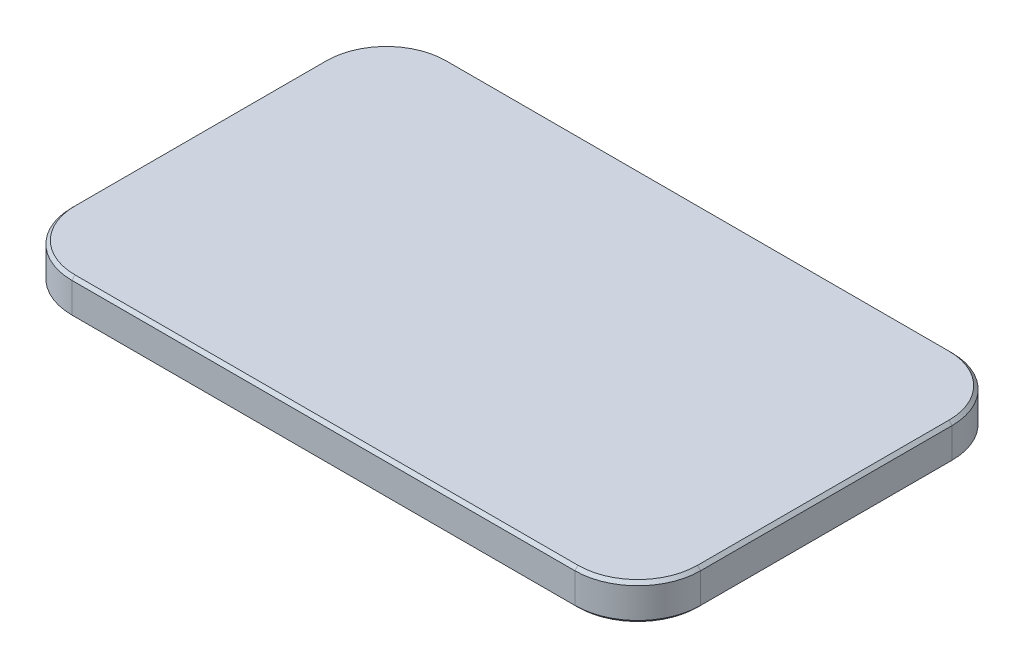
ISO-10303-21;
HEADER;
FILE_DESCRIPTION(('STEP AP214'),'2;1');
FILE_NAME('part.step','',(''),(''),'','','');
FILE_SCHEMA(('AUTOMOTIVE_DESIGN { 1 0 10303 214 1 1 1 1 }'));
ENDSEC;
DATA;
#1=APPLICATION_CONTEXT('core data for automotive mechanical design processes');
#2=APPLICATION_PROTOCOL_DEFINITION('international standard','automotive_design',2000,#1);
#3=PRODUCT_CONTEXT('',#1,'mechanical');
#4=PRODUCT('Part','Part','',(#3));
#5=PRODUCT_RELATED_PRODUCT_CATEGORY('part','',(#4));
#6=PRODUCT_DEFINITION_FORMATION('','',#4);
#7=PRODUCT_DEFINITION_CONTEXT('part definition',#1,'design');
#8=PRODUCT_DEFINITION('design','',#6,#7);
#9=PRODUCT_DEFINITION_SHAPE('','',#8);
#10=(LENGTH_UNIT() NAMED_UNIT(*) SI_UNIT(.MILLI.,.METRE.));
#11=(NAMED_UNIT(*) PLANE_ANGLE_UNIT() SI_UNIT($,.RADIAN.));
#12=(NAMED_UNIT(*) SI_UNIT($,.STERADIAN.) SOLID_ANGLE_UNIT());
#13=UNCERTAINTY_MEASURE_WITH_UNIT(LENGTH_MEASURE(1.E-05),#10,'distance_accuracy_value','');
#14=(GEOMETRIC_REPRESENTATION_CONTEXT(3) GLOBAL_UNCERTAINTY_ASSIGNED_CONTEXT((#13)) GLOBAL_UNIT_ASSIGNED_CONTEXT((#10,
#11,#12)) REPRESENTATION_CONTEXT('',''));
#15=CARTESIAN_POINT('',(0.,0.,0.));
#16=DIRECTION('',(0.,0.,1.));
#17=DIRECTION('',(1.,0.,0.));
#18=AXIS2_PLACEMENT_3D('',#15,#16,#17);
#19=CARTESIAN_POINT('',(-63.5,7.34272236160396,-38.1));
#20=DIRECTION('',(1.,0.,0.));
#21=DIRECTION('',(0.,0.,-1.));
#22=AXIS2_PLACEMENT_3D('',#19,#20,#21);
#23=PLANE('',#22);
#24=DIRECTION('',(0.,-1.,0.));
#25=VECTOR('',#24,1.);
#26=CARTESIAN_POINT('',(-63.5,7.34272236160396,-25.4));
#27=LINE('',#26,#25);
#28=CARTESIAN_POINT('',(-63.5,6.70772236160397,-25.4));
#29=VERTEX_POINT('',#28);
#30=CARTESIAN_POINT('',(-63.5,0.634999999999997,-25.4));
#31=VERTEX_POINT('',#30);
#32=EDGE_CURVE('E277',#29,#31,#27,.T.);
#33=ORIENTED_EDGE('',*,*,#32,.T.);
#34=DIRECTION('',(0.,0.,1.));
#35=VECTOR('',#34,1.);
#36=CARTESIAN_POINT('',(-63.5,0.634999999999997,-38.1));
#37=LINE('',#36,#35);
#38=CARTESIAN_POINT('',(-63.5,0.634999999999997,25.4));
#39=VERTEX_POINT('',#38);
#40=EDGE_CURVE('E205',#31,#39,#37,.T.);
#41=ORIENTED_EDGE('',*,*,#40,.T.);
#42=DIRECTION('',(0.,-1.,0.));
#43=VECTOR('',#42,1.);
#44=CARTESIAN_POINT('',(-63.5,7.34272236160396,25.4));
#45=LINE('',#44,#43);
#46=CARTESIAN_POINT('',(-63.5,6.70772236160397,25.4));
#47=VERTEX_POINT('',#46);
#48=EDGE_CURVE('E236',#39,#47,#45,.F.);
#49=ORIENTED_EDGE('',*,*,#48,.T.);
#50=DIRECTION('',(0.,0.,-1.));
#51=VECTOR('',#50,1.);
#52=CARTESIAN_POINT('',(-63.5,6.70772236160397,-25.4));
#53=LINE('',#52,#51);
#54=EDGE_CURVE('E203',#47,#29,#53,.T.);
#55=ORIENTED_EDGE('',*,*,#54,.T.);
#56=EDGE_LOOP('',(#33,#41,#49,#55));
#57=FACE_BOUND('',#56,.T.);
#58=ADVANCED_FACE('F31',(#57),#23,.F.);
#59=CARTESIAN_POINT('',(-63.5,7.34272236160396,38.1));
#60=DIRECTION('',(0.,0.,-1.));
#61=DIRECTION('',(-1.,0.,0.));
#62=AXIS2_PLACEMENT_3D('',#59,#60,#61);
#63=PLANE('',#62);
#64=DIRECTION('',(0.,-1.,0.));
#65=VECTOR('',#64,1.);
#66=CARTESIAN_POINT('',(-50.8,7.34272236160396,38.1));
#67=LINE('',#66,#65);
#68=CARTESIAN_POINT('',(-50.8,6.70772236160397,38.1));
#69=VERTEX_POINT('',#68);
#70=CARTESIAN_POINT('',(-50.8,0.634999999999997,38.1));
#71=VERTEX_POINT('',#70);
#72=EDGE_CURVE('E164',#69,#71,#67,.T.);
#73=ORIENTED_EDGE('',*,*,#72,.T.);
#74=DIRECTION('',(1.,0.,0.));
#75=VECTOR('',#74,1.);
#76=CARTESIAN_POINT('',(-63.5,0.634999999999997,38.1));
#77=LINE('',#76,#75);
#78=CARTESIAN_POINT('',(50.8,0.634999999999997,38.1));
#79=VERTEX_POINT('',#78);
#80=EDGE_CURVE('E180',#71,#79,#77,.T.);
#81=ORIENTED_EDGE('',*,*,#80,.T.);
#82=DIRECTION('',(0.,-1.,0.));
#83=VECTOR('',#82,1.);
#84=CARTESIAN_POINT('',(50.8,7.34272236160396,38.1));
#85=LINE('',#84,#83);
#86=CARTESIAN_POINT('',(50.8,6.70772236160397,38.1));
#87=VERTEX_POINT('',#86);
#88=EDGE_CURVE('E293',#79,#87,#85,.F.);
#89=ORIENTED_EDGE('',*,*,#88,.T.);
#90=DIRECTION('',(-1.,0.,0.));
#91=VECTOR('',#90,1.);
#92=CARTESIAN_POINT('',(-50.8,6.70772236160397,38.1));
#93=LINE('',#92,#91);
#94=EDGE_CURVE('E178',#87,#69,#93,.T.);
#95=ORIENTED_EDGE('',*,*,#94,.T.);
#96=EDGE_LOOP('',(#73,#81,#89,#95));
#97=FACE_BOUND('',#96,.T.);
#98=ADVANCED_FACE('F315',(#97),#63,.F.);
#99=CARTESIAN_POINT('',(63.5,7.34272236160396,-38.1));
#100=DIRECTION('',(-1.,0.,0.));
#101=DIRECTION('',(0.,0.,1.));
#102=AXIS2_PLACEMENT_3D('',#99,#100,#101);
#103=PLANE('',#102);
#104=DIRECTION('',(0.,-1.,0.));
#105=VECTOR('',#104,1.);
#106=CARTESIAN_POINT('',(63.5,7.34272236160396,25.4));
#107=LINE('',#106,#105);
#108=CARTESIAN_POINT('',(63.5,6.70772236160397,25.4));
#109=VERTEX_POINT('',#108);
#110=CARTESIAN_POINT('',(63.5,0.634999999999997,25.4));
#111=VERTEX_POINT('',#110);
#112=EDGE_CURVE('E287',#109,#111,#107,.T.);
#113=ORIENTED_EDGE('',*,*,#112,.T.);
#114=DIRECTION('',(0.,0.,-1.));
#115=VECTOR('',#114,1.);
#116=CARTESIAN_POINT('',(63.5,0.634999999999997,-38.1));
#117=LINE('',#116,#115);
#118=CARTESIAN_POINT('',(63.5,0.634999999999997,-25.4));
#119=VERTEX_POINT('',#118);
#120=EDGE_CURVE('E188',#111,#119,#117,.T.);
#121=ORIENTED_EDGE('',*,*,#120,.T.);
#122=DIRECTION('',(0.,-1.,0.));
#123=VECTOR('',#122,1.);
#124=CARTESIAN_POINT('',(63.5,7.34272236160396,-25.4));
#125=LINE('',#124,#123);
#126=CARTESIAN_POINT('',(63.5,6.70772236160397,-25.4));
#127=VERTEX_POINT('',#126);
#128=EDGE_CURVE('E290',#119,#127,#125,.F.);
#129=ORIENTED_EDGE('',*,*,#128,.T.);
#130=DIRECTION('',(0.,0.,1.));
#131=VECTOR('',#130,1.);
#132=CARTESIAN_POINT('',(63.5,6.70772236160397,25.4));
#133=LINE('',#132,#131);
#134=EDGE_CURVE('E186',#127,#109,#133,.T.);
#135=ORIENTED_EDGE('',*,*,#134,.T.);
#136=EDGE_LOOP('',(#113,#121,#129,#135));
#137=FACE_BOUND('',#136,.T.);
#138=ADVANCED_FACE('F359',(#137),#103,.F.);
#139=CARTESIAN_POINT('',(-63.5,7.34272236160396,-38.1));
#140=DIRECTION('',(0.,0.,1.));
#141=DIRECTION('',(1.,0.,0.));
#142=AXIS2_PLACEMENT_3D('',#139,#140,#141);
#143=PLANE('',#142);
#144=DIRECTION('',(0.,-1.,0.));
#145=VECTOR('',#144,1.);
#146=CARTESIAN_POINT('',(50.8,7.34272236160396,-38.1));
#147=LINE('',#146,#145);
#148=CARTESIAN_POINT('',(50.8,6.70772236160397,-38.1));
#149=VERTEX_POINT('',#148);
#150=CARTESIAN_POINT('',(50.8,0.634999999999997,-38.1));
#151=VERTEX_POINT('',#150);
#152=EDGE_CURVE('E279',#149,#151,#147,.T.);
#153=ORIENTED_EDGE('',*,*,#152,.T.);
#154=DIRECTION('',(-1.,0.,0.));
#155=VECTOR('',#154,1.);
#156=CARTESIAN_POINT('',(-63.5,0.634999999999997,-38.1));
#157=LINE('',#156,#155);
#158=CARTESIAN_POINT('',(-50.8,0.634999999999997,-38.1));
#159=VERTEX_POINT('',#158);
#160=EDGE_CURVE('E197',#151,#159,#157,.T.);
#161=ORIENTED_EDGE('',*,*,#160,.T.);
#162=DIRECTION('',(0.,-1.,0.));
#163=VECTOR('',#162,1.);
#164=CARTESIAN_POINT('',(-50.8,7.34272236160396,-38.1));
#165=LINE('',#164,#163);
#166=CARTESIAN_POINT('',(-50.8,6.70772236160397,-38.1));
#167=VERTEX_POINT('',#166);
#168=EDGE_CURVE('E284',#159,#167,#165,.F.);
#169=ORIENTED_EDGE('',*,*,#168,.T.);
#170=DIRECTION('',(1.,0.,0.));
#171=VECTOR('',#170,1.);
#172=CARTESIAN_POINT('',(50.8,6.70772236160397,-38.1));
#173=LINE('',#172,#171);
#174=EDGE_CURVE('E195',#167,#149,#173,.T.);
#175=ORIENTED_EDGE('',*,*,#174,.T.);
#176=EDGE_LOOP('',(#153,#161,#169,#175));
#177=FACE_BOUND('',#176,.T.);
#178=ADVANCED_FACE('F343',(#177),#143,.F.);
#179=CARTESIAN_POINT('',(-63.5,7.34272236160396,38.1));
#180=DIRECTION('',(0.,1.,0.));
#181=DIRECTION('',(0.,0.,1.));
#182=AXIS2_PLACEMENT_3D('',#179,#180,#181);
#183=PLANE('',#182);
#184=DIRECTION('',(0.,0.,-1.));
#185=VECTOR('',#184,1.);
#186=CARTESIAN_POINT('',(62.865,7.34272236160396,-25.4));
#187=LINE('',#186,#185);
#188=CARTESIAN_POINT('',(62.865,7.34272236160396,25.4));
#189=VERTEX_POINT('',#188);
#190=CARTESIAN_POINT('',(62.865,7.34272236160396,-25.4));
#191=VERTEX_POINT('',#190);
#192=EDGE_CURVE('E40',#189,#191,#187,.T.);
#193=ORIENTED_EDGE('',*,*,#192,.T.);
#194=CARTESIAN_POINT('',(50.8,7.34272236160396,-25.4));
#195=DIRECTION('',(0.,1.,0.));
#196=DIRECTION('',(0.,0.,1.));
#197=AXIS2_PLACEMENT_3D('',#194,#195,#196);
#198=CIRCLE('',#197,12.065);
#199=CARTESIAN_POINT('',(50.8,7.34272236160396,-37.465));
#200=VERTEX_POINT('',#199);
#201=EDGE_CURVE('E11',#191,#200,#198,.T.);
#202=ORIENTED_EDGE('',*,*,#201,.T.);
#203=DIRECTION('',(-1.,0.,0.));
#204=VECTOR('',#203,1.);
#205=CARTESIAN_POINT('',(-50.8,7.34272236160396,-37.465));
#206=LINE('',#205,#204);
#207=CARTESIAN_POINT('',(-50.8,7.34272236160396,-37.465));
#208=VERTEX_POINT('',#207);
#209=EDGE_CURVE('E207',#200,#208,#206,.T.);
#210=ORIENTED_EDGE('',*,*,#209,.T.);
#211=CARTESIAN_POINT('',(-50.8,7.34272236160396,-25.4));
#212=DIRECTION('',(0.,1.,0.));
#213=DIRECTION('',(0.,0.,1.));
#214=AXIS2_PLACEMENT_3D('',#211,#212,#213);
#215=CIRCLE('',#214,12.065);
#216=CARTESIAN_POINT('',(-62.865,7.34272236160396,-25.4));
#217=VERTEX_POINT('',#216);
#218=EDGE_CURVE('E209',#208,#217,#215,.T.);
#219=ORIENTED_EDGE('',*,*,#218,.T.);
#220=DIRECTION('',(0.,0.,1.));
#221=VECTOR('',#220,1.);
#222=CARTESIAN_POINT('',(-62.865,7.34272236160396,25.4));
#223=LINE('',#222,#221);
#224=CARTESIAN_POINT('',(-62.865,7.34272236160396,25.4));
#225=VERTEX_POINT('',#224);
#226=EDGE_CURVE('E211',#217,#225,#223,.T.);
#227=ORIENTED_EDGE('',*,*,#226,.T.);
#228=CARTESIAN_POINT('',(-50.8,7.34272236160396,25.4));
#229=DIRECTION('',(0.,1.,0.));
#230=DIRECTION('',(0.,0.,1.));
#231=AXIS2_PLACEMENT_3D('',#228,#229,#230);
#232=CIRCLE('',#231,12.065);
#233=CARTESIAN_POINT('',(-50.8,7.34272236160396,37.465));
#234=VERTEX_POINT('',#233);
#235=EDGE_CURVE('E213',#225,#234,#232,.T.);
#236=ORIENTED_EDGE('',*,*,#235,.T.);
#237=DIRECTION('',(1.,0.,0.));
#238=VECTOR('',#237,1.);
#239=CARTESIAN_POINT('',(50.8,7.34272236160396,37.465));
#240=LINE('',#239,#238);
#241=CARTESIAN_POINT('',(50.8,7.34272236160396,37.465));
#242=VERTEX_POINT('',#241);
#243=EDGE_CURVE('E215',#234,#242,#240,.T.);
#244=ORIENTED_EDGE('',*,*,#243,.T.);
#245=CARTESIAN_POINT('',(50.8,7.34272236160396,25.4));
#246=DIRECTION('',(0.,1.,0.));
#247=DIRECTION('',(0.,0.,1.));
#248=AXIS2_PLACEMENT_3D('',#245,#246,#247);
#249=CIRCLE('',#248,12.065);
#250=EDGE_CURVE('E51',#242,#189,#249,.T.);
#251=ORIENTED_EDGE('',*,*,#250,.T.);
#252=EDGE_LOOP('',(#193,#202,#210,#219,#227,#236,#244,#251));
#253=FACE_BOUND('',#252,.T.);
#254=ADVANCED_FACE('F331',(#253),#183,.T.);
#255=CARTESIAN_POINT('',(-63.5,0.,38.1));
#256=DIRECTION('',(0.,1.,0.));
#257=DIRECTION('',(0.,0.,1.));
#258=AXIS2_PLACEMENT_3D('',#255,#256,#257);
#259=PLANE('',#258);
#260=DIRECTION('',(-1.,0.,0.));
#261=VECTOR('',#260,1.);
#262=CARTESIAN_POINT('',(-63.5,0.,37.465));
#263=LINE('',#262,#261);
#264=CARTESIAN_POINT('',(50.8,0.,37.465));
#265=VERTEX_POINT('',#264);
#266=CARTESIAN_POINT('',(-50.8,0.,37.465));
#267=VERTEX_POINT('',#266);
#268=EDGE_CURVE('E168',#265,#267,#263,.T.);
#269=ORIENTED_EDGE('',*,*,#268,.T.);
#270=CARTESIAN_POINT('',(-50.8,0.,25.4));
#271=DIRECTION('',(0.,1.,0.));
#272=DIRECTION('',(0.,0.,1.));
#273=AXIS2_PLACEMENT_3D('',#270,#271,#272);
#274=CIRCLE('',#273,12.065);
#275=CARTESIAN_POINT('',(-62.865,0.,25.4));
#276=VERTEX_POINT('',#275);
#277=EDGE_CURVE('E149',#267,#276,#274,.F.);
#278=ORIENTED_EDGE('',*,*,#277,.T.);
#279=DIRECTION('',(0.,0.,-1.));
#280=VECTOR('',#279,1.);
#281=CARTESIAN_POINT('',(-62.865,0.,38.1));
#282=LINE('',#281,#280);
#283=CARTESIAN_POINT('',(-62.865,0.,-25.4));
#284=VERTEX_POINT('',#283);
#285=EDGE_CURVE('E157',#276,#284,#282,.T.);
#286=ORIENTED_EDGE('',*,*,#285,.T.);
#287=CARTESIAN_POINT('',(-50.8,0.,-25.4));
#288=DIRECTION('',(0.,1.,0.));
#289=DIRECTION('',(0.,0.,1.));
#290=AXIS2_PLACEMENT_3D('',#287,#288,#289);
#291=CIRCLE('',#290,12.065);
#292=CARTESIAN_POINT('',(-50.8,0.,-37.465));
#293=VERTEX_POINT('',#292);
#294=EDGE_CURVE('E163',#284,#293,#291,.F.);
#295=ORIENTED_EDGE('',*,*,#294,.T.);
#296=DIRECTION('',(1.,0.,0.));
#297=VECTOR('',#296,1.);
#298=CARTESIAN_POINT('',(-63.5,0.,-37.465));
#299=LINE('',#298,#297);
#300=CARTESIAN_POINT('',(50.8,0.,-37.465));
#301=VERTEX_POINT('',#300);
#302=EDGE_CURVE('E298',#293,#301,#299,.T.);
#303=ORIENTED_EDGE('',*,*,#302,.T.);
#304=CARTESIAN_POINT('',(50.8,0.,-25.4));
#305=DIRECTION('',(0.,1.,0.));
#306=DIRECTION('',(0.,0.,1.));
#307=AXIS2_PLACEMENT_3D('',#304,#305,#306);
#308=CIRCLE('',#307,12.065);
#309=CARTESIAN_POINT('',(62.865,0.,-25.4));
#310=VERTEX_POINT('',#309);
#311=EDGE_CURVE('E300',#301,#310,#308,.F.);
#312=ORIENTED_EDGE('',*,*,#311,.T.);
#313=DIRECTION('',(0.,0.,1.));
#314=VECTOR('',#313,1.);
#315=CARTESIAN_POINT('',(62.865,0.,38.1));
#316=LINE('',#315,#314);
#317=CARTESIAN_POINT('',(62.865,0.,25.4));
#318=VERTEX_POINT('',#317);
#319=EDGE_CURVE('E302',#310,#318,#316,.T.);
#320=ORIENTED_EDGE('',*,*,#319,.T.);
#321=CARTESIAN_POINT('',(50.8,0.,25.4));
#322=DIRECTION('',(0.,1.,0.));
#323=DIRECTION('',(0.,0.,1.));
#324=AXIS2_PLACEMENT_3D('',#321,#322,#323);
#325=CIRCLE('',#324,12.065);
#326=EDGE_CURVE('E173',#318,#265,#325,.F.);
#327=ORIENTED_EDGE('',*,*,#326,.T.);
#328=EDGE_LOOP('',(#269,#278,#286,#295,#303,#312,#320,#327));
#329=FACE_BOUND('',#328,.T.);
#330=ADVANCED_FACE('F166',(#329),#259,.F.);
#331=CARTESIAN_POINT('',(-50.8,7.34272236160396,-25.4));
#332=DIRECTION('',(0.,-1.,0.));
#333=DIRECTION('',(0.,0.,-1.));
#334=AXIS2_PLACEMENT_3D('',#331,#332,#333);
#335=CYLINDRICAL_SURFACE('',#334,12.7);
#336=ORIENTED_EDGE('',*,*,#168,.F.);
#337=CARTESIAN_POINT('',(-50.8,0.634999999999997,-25.4));
#338=DIRECTION('',(0.,1.,0.));
#339=DIRECTION('',(0.,0.,1.));
#340=AXIS2_PLACEMENT_3D('',#337,#338,#339);
#341=CIRCLE('',#340,12.7);
#342=EDGE_CURVE('E201',#159,#31,#341,.T.);
#343=ORIENTED_EDGE('',*,*,#342,.T.);
#344=ORIENTED_EDGE('',*,*,#32,.F.);
#345=CARTESIAN_POINT('',(-50.8,6.70772236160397,-25.4));
#346=DIRECTION('',(0.,1.,0.));
#347=DIRECTION('',(0.,0.,1.));
#348=AXIS2_PLACEMENT_3D('',#345,#346,#347);
#349=CIRCLE('',#348,12.7);
#350=EDGE_CURVE('E199',#29,#167,#349,.F.);
#351=ORIENTED_EDGE('',*,*,#350,.T.);
#352=EDGE_LOOP('',(#336,#343,#344,#351));
#353=FACE_BOUND('',#352,.T.);
#354=ADVANCED_FACE('F373',(#353),#335,.T.);
#355=CARTESIAN_POINT('',(50.8,7.34272236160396,-25.4));
#356=DIRECTION('',(0.,-1.,0.));
#357=DIRECTION('',(0.,0.,-1.));
#358=AXIS2_PLACEMENT_3D('',#355,#356,#357);
#359=CYLINDRICAL_SURFACE('',#358,12.7);
#360=ORIENTED_EDGE('',*,*,#128,.F.);
#361=CARTESIAN_POINT('',(50.8,0.634999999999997,-25.4));
#362=DIRECTION('',(0.,1.,0.));
#363=DIRECTION('',(0.,0.,1.));
#364=AXIS2_PLACEMENT_3D('',#361,#362,#363);
#365=CIRCLE('',#364,12.7);
#366=EDGE_CURVE('E193',#119,#151,#365,.T.);
#367=ORIENTED_EDGE('',*,*,#366,.T.);
#368=ORIENTED_EDGE('',*,*,#152,.F.);
#369=CARTESIAN_POINT('',(50.8,6.70772236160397,-25.4));
#370=DIRECTION('',(0.,1.,0.));
#371=DIRECTION('',(0.,0.,1.));
#372=AXIS2_PLACEMENT_3D('',#369,#370,#371);
#373=CIRCLE('',#372,12.7);
#374=EDGE_CURVE('E190',#149,#127,#373,.F.);
#375=ORIENTED_EDGE('',*,*,#374,.T.);
#376=EDGE_LOOP('',(#360,#367,#368,#375));
#377=FACE_BOUND('',#376,.T.);
#378=ADVANCED_FACE('F348',(#377),#359,.T.);
#379=CARTESIAN_POINT('',(-50.8,7.34272236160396,25.4));
#380=DIRECTION('',(0.,-1.,0.));
#381=DIRECTION('',(0.,0.,-1.));
#382=AXIS2_PLACEMENT_3D('',#379,#380,#381);
#383=CYLINDRICAL_SURFACE('',#382,12.7);
#384=ORIENTED_EDGE('',*,*,#48,.F.);
#385=CARTESIAN_POINT('',(-50.8,0.634999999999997,25.4));
#386=DIRECTION('',(0.,1.,0.));
#387=DIRECTION('',(0.,0.,1.));
#388=AXIS2_PLACEMENT_3D('',#385,#386,#387);
#389=CIRCLE('',#388,12.7);
#390=EDGE_CURVE('E151',#39,#71,#389,.T.);
#391=ORIENTED_EDGE('',*,*,#390,.T.);
#392=ORIENTED_EDGE('',*,*,#72,.F.);
#393=CARTESIAN_POINT('',(-50.8,6.70772236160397,25.4));
#394=DIRECTION('',(0.,1.,0.));
#395=DIRECTION('',(0.,0.,1.));
#396=AXIS2_PLACEMENT_3D('',#393,#394,#395);
#397=CIRCLE('',#396,12.7);
#398=EDGE_CURVE('E170',#69,#47,#397,.F.);
#399=ORIENTED_EDGE('',*,*,#398,.T.);
#400=EDGE_LOOP('',(#384,#391,#392,#399));
#401=FACE_BOUND('',#400,.T.);
#402=ADVANCED_FACE('F272',(#401),#383,.T.);
#403=CARTESIAN_POINT('',(50.8,7.34272236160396,25.4));
#404=DIRECTION('',(0.,-1.,0.));
#405=DIRECTION('',(0.,0.,-1.));
#406=AXIS2_PLACEMENT_3D('',#403,#404,#405);
#407=CYLINDRICAL_SURFACE('',#406,12.7);
#408=ORIENTED_EDGE('',*,*,#88,.F.);
#409=CARTESIAN_POINT('',(50.8,0.634999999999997,25.4));
#410=DIRECTION('',(0.,1.,0.));
#411=DIRECTION('',(0.,0.,1.));
#412=AXIS2_PLACEMENT_3D('',#409,#410,#411);
#413=CIRCLE('',#412,12.7);
#414=EDGE_CURVE('E184',#79,#111,#413,.T.);
#415=ORIENTED_EDGE('',*,*,#414,.T.);
#416=ORIENTED_EDGE('',*,*,#112,.F.);
#417=CARTESIAN_POINT('',(50.8,6.70772236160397,25.4));
#418=DIRECTION('',(0.,1.,0.));
#419=DIRECTION('',(0.,0.,1.));
#420=AXIS2_PLACEMENT_3D('',#417,#418,#419);
#421=CIRCLE('',#420,12.7);
#422=EDGE_CURVE('E182',#109,#87,#421,.F.);
#423=ORIENTED_EDGE('',*,*,#422,.T.);
#424=EDGE_LOOP('',(#408,#415,#416,#423));
#425=FACE_BOUND('',#424,.T.);
#426=ADVANCED_FACE('F317',(#425),#407,.T.);
#427=CARTESIAN_POINT('',(50.8,0.,-25.4));
#428=DIRECTION('',(0.,1.,0.));
#429=DIRECTION('',(0.,0.,1.));
#430=AXIS2_PLACEMENT_3D('',#427,#428,#429);
#431=CONICAL_SURFACE('',#430,12.065,0.785398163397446);
#432=DIRECTION('',(0.,-0.707106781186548,0.707106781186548));
#433=VECTOR('',#432,1.);
#434=CARTESIAN_POINT('',(50.8,0.634999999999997,-38.1));
#435=LINE('',#434,#433);
#436=EDGE_CURVE('E230',#151,#301,#435,.T.);
#437=ORIENTED_EDGE('',*,*,#436,.F.);
#438=ORIENTED_EDGE('',*,*,#366,.F.);
#439=DIRECTION('',(0.707106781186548,0.707106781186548,0.));
#440=VECTOR('',#439,1.);
#441=CARTESIAN_POINT('',(62.865,0.,-25.4));
#442=LINE('',#441,#440);
#443=EDGE_CURVE('E233',#310,#119,#442,.T.);
#444=ORIENTED_EDGE('',*,*,#443,.F.);
#445=ORIENTED_EDGE('',*,*,#311,.F.);
#446=EDGE_LOOP('',(#437,#438,#444,#445));
#447=FACE_BOUND('',#446,.T.);
#448=ADVANCED_FACE('F352',(#447),#431,.T.);
#449=CARTESIAN_POINT('',(63.5,0.634999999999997,-38.1));
#450=DIRECTION('',(-0.707106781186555,0.70710678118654,0.));
#451=DIRECTION('',(-0.70710678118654,-0.707106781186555,0.));
#452=AXIS2_PLACEMENT_3D('',#449,#450,#451);
#453=PLANE('',#452);
#454=ORIENTED_EDGE('',*,*,#443,.T.);
#455=ORIENTED_EDGE('',*,*,#120,.F.);
#456=DIRECTION('',(0.70710678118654,0.707106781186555,0.));
#457=VECTOR('',#456,1.);
#458=CARTESIAN_POINT('',(62.865,0.,25.4));
#459=LINE('',#458,#457);
#460=EDGE_CURVE('E227',#318,#111,#459,.T.);
#461=ORIENTED_EDGE('',*,*,#460,.F.);
#462=ORIENTED_EDGE('',*,*,#319,.F.);
#463=EDGE_LOOP('',(#454,#455,#461,#462));
#464=FACE_BOUND('',#463,.T.);
#465=ADVANCED_FACE('F357',(#464),#453,.F.);
#466=CARTESIAN_POINT('',(-63.5,0.634999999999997,-38.1));
#467=DIRECTION('',(0.,0.707106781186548,0.707106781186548));
#468=DIRECTION('',(0.,-0.707106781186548,0.707106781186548));
#469=AXIS2_PLACEMENT_3D('',#466,#467,#468);
#470=PLANE('',#469);
#471=ORIENTED_EDGE('',*,*,#436,.T.);
#472=ORIENTED_EDGE('',*,*,#302,.F.);
#473=DIRECTION('',(0.,-0.707106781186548,0.707106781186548));
#474=VECTOR('',#473,1.);
#475=CARTESIAN_POINT('',(-50.8,0.634999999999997,-38.1));
#476=LINE('',#475,#474);
#477=EDGE_CURVE('E224',#159,#293,#476,.T.);
#478=ORIENTED_EDGE('',*,*,#477,.F.);
#479=ORIENTED_EDGE('',*,*,#160,.F.);
#480=EDGE_LOOP('',(#471,#472,#478,#479));
#481=FACE_BOUND('',#480,.T.);
#482=ADVANCED_FACE('F395',(#481),#470,.F.);
#483=CARTESIAN_POINT('',(50.8,0.,25.4));
#484=DIRECTION('',(0.,1.,0.));
#485=DIRECTION('',(0.,0.,1.));
#486=AXIS2_PLACEMENT_3D('',#483,#484,#485);
#487=CONICAL_SURFACE('',#486,12.065,0.785398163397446);
#488=ORIENTED_EDGE('',*,*,#460,.T.);
#489=ORIENTED_EDGE('',*,*,#414,.F.);
#490=DIRECTION('',(0.,0.707106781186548,0.707106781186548));
#491=VECTOR('',#490,1.);
#492=CARTESIAN_POINT('',(50.8,0.,37.465));
#493=LINE('',#492,#491);
#494=EDGE_CURVE('E221',#265,#79,#493,.T.);
#495=ORIENTED_EDGE('',*,*,#494,.F.);
#496=ORIENTED_EDGE('',*,*,#326,.F.);
#497=EDGE_LOOP('',(#488,#489,#495,#496));
#498=FACE_BOUND('',#497,.T.);
#499=ADVANCED_FACE('F309',(#498),#487,.T.);
#500=CARTESIAN_POINT('',(-50.8,0.,-25.4));
#501=DIRECTION('',(0.,1.,0.));
#502=DIRECTION('',(0.,0.,1.));
#503=AXIS2_PLACEMENT_3D('',#500,#501,#502);
#504=CONICAL_SURFACE('',#503,12.065,0.785398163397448);
#505=ORIENTED_EDGE('',*,*,#477,.T.);
#506=ORIENTED_EDGE('',*,*,#294,.F.);
#507=DIRECTION('',(0.707106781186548,-0.707106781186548,0.));
#508=VECTOR('',#507,1.);
#509=CARTESIAN_POINT('',(-63.5,0.634999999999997,-25.4));
#510=LINE('',#509,#508);
#511=EDGE_CURVE('E160',#31,#284,#510,.T.);
#512=ORIENTED_EDGE('',*,*,#511,.F.);
#513=ORIENTED_EDGE('',*,*,#342,.F.);
#514=EDGE_LOOP('',(#505,#506,#512,#513));
#515=FACE_BOUND('',#514,.T.);
#516=ADVANCED_FACE('F389',(#515),#504,.T.);
#517=CARTESIAN_POINT('',(-63.5,0.634999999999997,38.1));
#518=DIRECTION('',(0.,0.707106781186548,-0.707106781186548));
#519=DIRECTION('',(0.,0.707106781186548,0.707106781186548));
#520=AXIS2_PLACEMENT_3D('',#517,#518,#519);
#521=PLANE('',#520);
#522=ORIENTED_EDGE('',*,*,#494,.T.);
#523=ORIENTED_EDGE('',*,*,#80,.F.);
#524=DIRECTION('',(0.,0.707106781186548,0.707106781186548));
#525=VECTOR('',#524,1.);
#526=CARTESIAN_POINT('',(-50.8,0.,37.465));
#527=LINE('',#526,#525);
#528=EDGE_CURVE('E154',#267,#71,#527,.T.);
#529=ORIENTED_EDGE('',*,*,#528,.F.);
#530=ORIENTED_EDGE('',*,*,#268,.F.);
#531=EDGE_LOOP('',(#522,#523,#529,#530));
#532=FACE_BOUND('',#531,.T.);
#533=ADVANCED_FACE('F312',(#532),#521,.F.);
#534=CARTESIAN_POINT('',(-63.5,0.634999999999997,-38.1));
#535=DIRECTION('',(0.707106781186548,0.707106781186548,0.));
#536=DIRECTION('',(-0.707106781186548,0.707106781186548,0.));
#537=AXIS2_PLACEMENT_3D('',#534,#535,#536);
#538=PLANE('',#537);
#539=ORIENTED_EDGE('',*,*,#511,.T.);
#540=ORIENTED_EDGE('',*,*,#285,.F.);
#541=DIRECTION('',(0.707106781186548,-0.707106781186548,0.));
#542=VECTOR('',#541,1.);
#543=CARTESIAN_POINT('',(-63.5,0.634999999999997,25.4));
#544=LINE('',#543,#542);
#545=EDGE_CURVE('E145',#39,#276,#544,.T.);
#546=ORIENTED_EDGE('',*,*,#545,.F.);
#547=ORIENTED_EDGE('',*,*,#40,.F.);
#548=EDGE_LOOP('',(#539,#540,#546,#547));
#549=FACE_BOUND('',#548,.T.);
#550=ADVANCED_FACE('F158',(#549),#538,.F.);
#551=CARTESIAN_POINT('',(-50.8,0.,25.4));
#552=DIRECTION('',(0.,1.,0.));
#553=DIRECTION('',(0.,0.,1.));
#554=AXIS2_PLACEMENT_3D('',#551,#552,#553);
#555=CONICAL_SURFACE('',#554,12.065,0.785398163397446);
#556=ORIENTED_EDGE('',*,*,#528,.T.);
#557=ORIENTED_EDGE('',*,*,#390,.F.);
#558=ORIENTED_EDGE('',*,*,#545,.T.);
#559=ORIENTED_EDGE('',*,*,#277,.F.);
#560=EDGE_LOOP('',(#556,#557,#558,#559));
#561=FACE_BOUND('',#560,.T.);
#562=ADVANCED_FACE('F147',(#561),#555,.T.);
#563=CARTESIAN_POINT('',(-50.8,7.34272236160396,25.4));
#564=DIRECTION('',(0.,-1.,0.));
#565=DIRECTION('',(0.,0.,-1.));
#566=AXIS2_PLACEMENT_3D('',#563,#564,#565);
#567=CONICAL_SURFACE('',#566,12.065,0.785398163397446);
#568=DIRECTION('',(0.707106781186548,0.707106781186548,0.));
#569=VECTOR('',#568,1.);
#570=CARTESIAN_POINT('',(-63.5,6.70772236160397,25.4));
#571=LINE('',#570,#569);
#572=EDGE_CURVE('E252',#47,#225,#571,.T.);
#573=ORIENTED_EDGE('',*,*,#572,.F.);
#574=ORIENTED_EDGE('',*,*,#398,.F.);
#575=DIRECTION('',(0.,-0.707106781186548,0.707106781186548));
#576=VECTOR('',#575,1.);
#577=CARTESIAN_POINT('',(-50.8,7.34272236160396,37.465));
#578=LINE('',#577,#576);
#579=EDGE_CURVE('E35',#234,#69,#578,.T.);
#580=ORIENTED_EDGE('',*,*,#579,.F.);
#581=ORIENTED_EDGE('',*,*,#235,.F.);
#582=EDGE_LOOP('',(#573,#574,#580,#581));
#583=FACE_BOUND('',#582,.T.);
#584=ADVANCED_FACE('F33',(#583),#567,.T.);
#585=CARTESIAN_POINT('',(-63.5,7.34272236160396,37.465));
#586=DIRECTION('',(0.,0.707106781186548,0.707106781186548));
#587=DIRECTION('',(0.,-0.707106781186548,0.707106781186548));
#588=AXIS2_PLACEMENT_3D('',#585,#586,#587);
#589=PLANE('',#588);
#590=ORIENTED_EDGE('',*,*,#579,.T.);
#591=ORIENTED_EDGE('',*,*,#94,.F.);
#592=DIRECTION('',(0.,-0.707106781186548,0.707106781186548));
#593=VECTOR('',#592,1.);
#594=CARTESIAN_POINT('',(50.8,7.34272236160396,37.465));
#595=LINE('',#594,#593);
#596=EDGE_CURVE('E250',#242,#87,#595,.T.);
#597=ORIENTED_EDGE('',*,*,#596,.F.);
#598=ORIENTED_EDGE('',*,*,#243,.F.);
#599=EDGE_LOOP('',(#590,#591,#597,#598));
#600=FACE_BOUND('',#599,.T.);
#601=ADVANCED_FACE('F263',(#600),#589,.T.);
#602=CARTESIAN_POINT('',(-62.865,7.34272236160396,38.1));
#603=DIRECTION('',(-0.707106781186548,0.707106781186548,0.));
#604=DIRECTION('',(-0.707106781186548,-0.707106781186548,0.));
#605=AXIS2_PLACEMENT_3D('',#602,#603,#604);
#606=PLANE('',#605);
#607=ORIENTED_EDGE('',*,*,#572,.T.);
#608=ORIENTED_EDGE('',*,*,#226,.F.);
#609=DIRECTION('',(0.707106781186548,0.707106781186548,0.));
#610=VECTOR('',#609,1.);
#611=CARTESIAN_POINT('',(-63.5,6.70772236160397,-25.4));
#612=LINE('',#611,#610);
#613=EDGE_CURVE('E247',#29,#217,#612,.T.);
#614=ORIENTED_EDGE('',*,*,#613,.F.);
#615=ORIENTED_EDGE('',*,*,#54,.F.);
#616=EDGE_LOOP('',(#607,#608,#614,#615));
#617=FACE_BOUND('',#616,.T.);
#618=ADVANCED_FACE('F413',(#617),#606,.T.);
#619=CARTESIAN_POINT('',(50.8,7.34272236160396,25.4));
#620=DIRECTION('',(0.,-1.,0.));
#621=DIRECTION('',(0.,0.,-1.));
#622=AXIS2_PLACEMENT_3D('',#619,#620,#621);
#623=CONICAL_SURFACE('',#622,12.065,0.785398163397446);
#624=ORIENTED_EDGE('',*,*,#596,.T.);
#625=ORIENTED_EDGE('',*,*,#422,.F.);
#626=DIRECTION('',(0.707106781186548,-0.707106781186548,0.));
#627=VECTOR('',#626,1.);
#628=CARTESIAN_POINT('',(62.865,7.34272236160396,25.4));
#629=LINE('',#628,#627);
#630=EDGE_CURVE('E244',#189,#109,#629,.T.);
#631=ORIENTED_EDGE('',*,*,#630,.F.);
#632=ORIENTED_EDGE('',*,*,#250,.F.);
#633=EDGE_LOOP('',(#624,#625,#631,#632));
#634=FACE_BOUND('',#633,.T.);
#635=ADVANCED_FACE('F321',(#634),#623,.T.);
#636=CARTESIAN_POINT('',(-50.8,7.34272236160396,-25.4));
#637=DIRECTION('',(0.,-1.,0.));
#638=DIRECTION('',(0.,0.,-1.));
#639=AXIS2_PLACEMENT_3D('',#636,#637,#638);
#640=CONICAL_SURFACE('',#639,12.065,0.785398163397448);
#641=ORIENTED_EDGE('',*,*,#613,.T.);
#642=ORIENTED_EDGE('',*,*,#218,.F.);
#643=DIRECTION('',(0.,0.707106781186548,0.707106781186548));
#644=VECTOR('',#643,1.);
#645=CARTESIAN_POINT('',(-50.8,6.70772236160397,-38.1));
#646=LINE('',#645,#644);
#647=EDGE_CURVE('E241',#167,#208,#646,.T.);
#648=ORIENTED_EDGE('',*,*,#647,.F.);
#649=ORIENTED_EDGE('',*,*,#350,.F.);
#650=EDGE_LOOP('',(#641,#642,#648,#649));
#651=FACE_BOUND('',#650,.T.);
#652=ADVANCED_FACE('F336',(#651),#640,.T.);
#653=CARTESIAN_POINT('',(62.865,7.34272236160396,38.1));
#654=DIRECTION('',(0.707106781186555,0.70710678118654,0.));
#655=DIRECTION('',(-0.70710678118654,0.707106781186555,0.));
#656=AXIS2_PLACEMENT_3D('',#653,#654,#655);
#657=PLANE('',#656);
#658=ORIENTED_EDGE('',*,*,#630,.T.);
#659=ORIENTED_EDGE('',*,*,#134,.F.);
#660=DIRECTION('',(0.70710678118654,-0.707106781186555,0.));
#661=VECTOR('',#660,1.);
#662=CARTESIAN_POINT('',(62.865,7.34272236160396,-25.4));
#663=LINE('',#662,#661);
#664=EDGE_CURVE('E239',#191,#127,#663,.T.);
#665=ORIENTED_EDGE('',*,*,#664,.F.);
#666=ORIENTED_EDGE('',*,*,#192,.F.);
#667=EDGE_LOOP('',(#658,#659,#665,#666));
#668=FACE_BOUND('',#667,.T.);
#669=ADVANCED_FACE('F324',(#668),#657,.T.);
#670=CARTESIAN_POINT('',(-63.5,7.34272236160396,-37.465));
#671=DIRECTION('',(0.,0.707106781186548,-0.707106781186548));
#672=DIRECTION('',(0.,0.707106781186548,0.707106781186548));
#673=AXIS2_PLACEMENT_3D('',#670,#671,#672);
#674=PLANE('',#673);
#675=ORIENTED_EDGE('',*,*,#647,.T.);
#676=ORIENTED_EDGE('',*,*,#209,.F.);
#677=DIRECTION('',(0.,0.707106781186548,0.707106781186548));
#678=VECTOR('',#677,1.);
#679=CARTESIAN_POINT('',(50.8,6.70772236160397,-38.1));
#680=LINE('',#679,#678);
#681=EDGE_CURVE('E237',#149,#200,#680,.T.);
#682=ORIENTED_EDGE('',*,*,#681,.F.);
#683=ORIENTED_EDGE('',*,*,#174,.F.);
#684=EDGE_LOOP('',(#675,#676,#682,#683));
#685=FACE_BOUND('',#684,.T.);
#686=ADVANCED_FACE('F340',(#685),#674,.T.);
#687=CARTESIAN_POINT('',(50.8,7.34272236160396,-25.4));
#688=DIRECTION('',(0.,-1.,0.));
#689=DIRECTION('',(0.,0.,-1.));
#690=AXIS2_PLACEMENT_3D('',#687,#688,#689);
#691=CONICAL_SURFACE('',#690,12.065,0.785398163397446);
#692=ORIENTED_EDGE('',*,*,#664,.T.);
#693=ORIENTED_EDGE('',*,*,#374,.F.);
#694=ORIENTED_EDGE('',*,*,#681,.T.);
#695=ORIENTED_EDGE('',*,*,#201,.F.);
#696=EDGE_LOOP('',(#692,#693,#694,#695));
#697=FACE_BOUND('',#696,.T.);
#698=ADVANCED_FACE('F328',(#697),#691,.T.);
#699=CLOSED_SHELL('',(#58,#98,#138,#178,#254,#330,#354,#378,#402,#426,#448,#465,#482,#499,#516,
#533,#550,#562,#584,#601,#618,#635,#652,#669,#686,#698));
#700=MANIFOLD_SOLID_BREP('B2',#699);
#701=ADVANCED_BREP_SHAPE_REPRESENTATION('',(#18,#700),#14);
#702=SHAPE_DEFINITION_REPRESENTATION(#9,#701);
ENDSEC;
END-ISO-10303-21;
